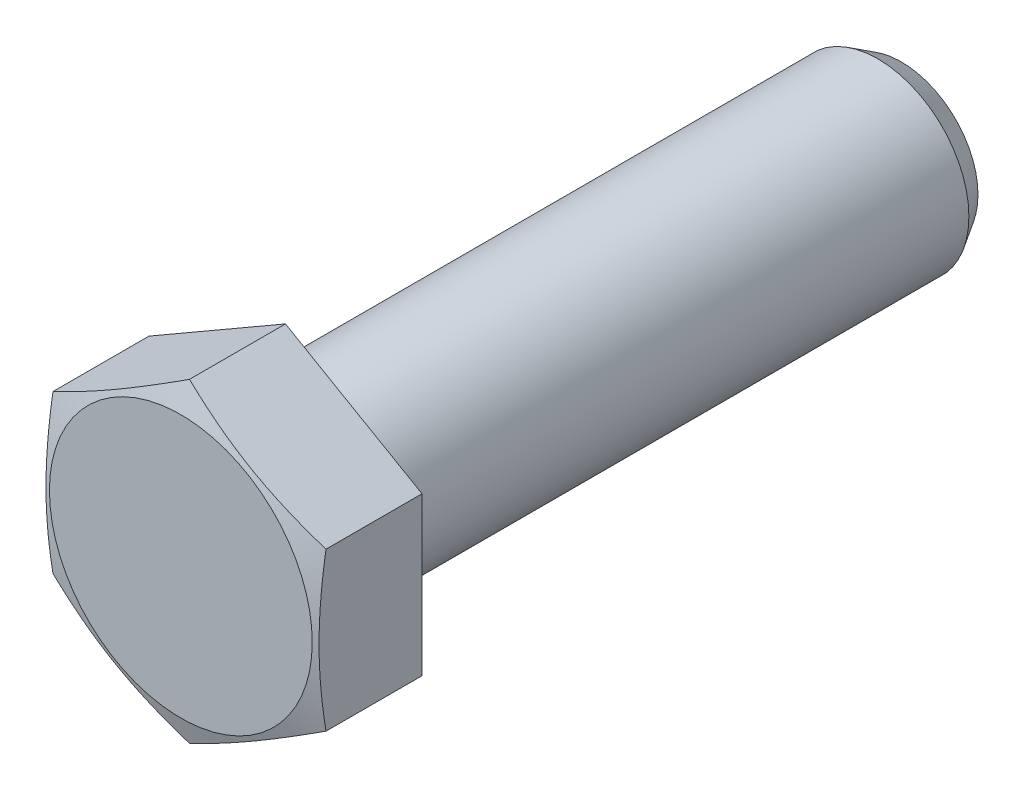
ISO-10303-21;
HEADER;
FILE_DESCRIPTION(('STEP AP214'),'2;1');
FILE_NAME('part.step','',(''),(''),'','','');
FILE_SCHEMA(('AUTOMOTIVE_DESIGN { 1 0 10303 214 1 1 1 1 }'));
ENDSEC;
DATA;
#1=APPLICATION_CONTEXT('core data for automotive mechanical design processes');
#2=APPLICATION_PROTOCOL_DEFINITION('international standard','automotive_design',2000,#1);
#3=PRODUCT_CONTEXT('',#1,'mechanical');
#4=PRODUCT('Part','Part','',(#3));
#5=PRODUCT_RELATED_PRODUCT_CATEGORY('part','',(#4));
#6=PRODUCT_DEFINITION_FORMATION('','',#4);
#7=PRODUCT_DEFINITION_CONTEXT('part definition',#1,'design');
#8=PRODUCT_DEFINITION('design','',#6,#7);
#9=PRODUCT_DEFINITION_SHAPE('','',#8);
#10=(LENGTH_UNIT() NAMED_UNIT(*) SI_UNIT(.MILLI.,.METRE.));
#11=(NAMED_UNIT(*) PLANE_ANGLE_UNIT() SI_UNIT($,.RADIAN.));
#12=(NAMED_UNIT(*) SI_UNIT($,.STERADIAN.) SOLID_ANGLE_UNIT());
#13=UNCERTAINTY_MEASURE_WITH_UNIT(LENGTH_MEASURE(1.E-05),#10,'distance_accuracy_value','');
#14=(GEOMETRIC_REPRESENTATION_CONTEXT(3) GLOBAL_UNCERTAINTY_ASSIGNED_CONTEXT((#13)) GLOBAL_UNIT_ASSIGNED_CONTEXT((#10,
#11,#12)) REPRESENTATION_CONTEXT('',''));
#15=CARTESIAN_POINT('',(0.,0.,0.));
#16=DIRECTION('',(0.,0.,1.));
#17=DIRECTION('',(1.,0.,0.));
#18=AXIS2_PLACEMENT_3D('',#15,#16,#17);
#19=CARTESIAN_POINT('',(0.,0.,0.6));
#20=DIRECTION('',(0.,0.,1.));
#21=DIRECTION('',(1.,0.,0.));
#22=AXIS2_PLACEMENT_3D('',#19,#20,#21);
#23=TOROIDAL_SURFACE('',#22,7.6,0.6);
#24=CARTESIAN_POINT('',(0.,0.,0.6));
#25=DIRECTION('',(0.,0.,1.));
#26=DIRECTION('',(1.,0.,0.));
#27=AXIS2_PLACEMENT_3D('',#24,#25,#26);
#28=CIRCLE('',#27,8.2);
#29=CARTESIAN_POINT('',(8.2,0.,0.600000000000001));
#30=VERTEX_POINT('',#29);
#31=EDGE_CURVE('E11',#30,#30,#28,.T.);
#32=ORIENTED_EDGE('',*,*,#31,.F.);
#33=EDGE_LOOP('',(#32));
#34=FACE_BOUND('',#33,.T.);
#35=CARTESIAN_POINT('',(0.,0.,0.));
#36=DIRECTION('',(0.,0.,1.));
#37=DIRECTION('',(1.,0.,0.));
#38=AXIS2_PLACEMENT_3D('',#35,#36,#37);
#39=CIRCLE('',#38,7.6);
#40=CARTESIAN_POINT('',(7.6,0.,0.));
#41=VERTEX_POINT('',#40);
#42=EDGE_CURVE('E39',#41,#41,#39,.T.);
#43=ORIENTED_EDGE('',*,*,#42,.T.);
#44=EDGE_LOOP('',(#43));
#45=FACE_BOUND('',#44,.T.);
#46=ADVANCED_FACE('F32',(#34,#45),#23,.T.);
#47=CARTESIAN_POINT('',(0.,7.6,0.));
#48=DIRECTION('',(0.,0.,-1.));
#49=DIRECTION('',(-1.,0.,0.));
#50=AXIS2_PLACEMENT_3D('',#47,#48,#49);
#51=PLANE('',#50);
#52=CARTESIAN_POINT('',(0.,0.,0.));
#53=DIRECTION('',(0.,0.,1.));
#54=DIRECTION('',(1.,0.,0.));
#55=AXIS2_PLACEMENT_3D('',#52,#53,#54);
#56=CIRCLE('',#55,6.6);
#57=CARTESIAN_POINT('',(6.6,0.,0.));
#58=VERTEX_POINT('',#57);
#59=EDGE_CURVE('E124',#58,#58,#56,.T.);
#60=ORIENTED_EDGE('',*,*,#59,.T.);
#61=EDGE_LOOP('',(#60));
#62=FACE_BOUND('',#61,.T.);
#63=ORIENTED_EDGE('',*,*,#42,.F.);
#64=EDGE_LOOP('',(#63));
#65=FACE_BOUND('',#64,.T.);
#66=ADVANCED_FACE('F130',(#62,#65),#51,.T.);
#67=CARTESIAN_POINT('',(0.,0.,-0.6));
#68=DIRECTION('',(0.,0.,1.));
#69=DIRECTION('',(1.,0.,0.));
#70=AXIS2_PLACEMENT_3D('',#67,#68,#69);
#71=TOROIDAL_SURFACE('',#70,6.6,0.6);
#72=CARTESIAN_POINT('',(0.,0.,-0.6));
#73=DIRECTION('',(0.,0.,1.));
#74=DIRECTION('',(1.,0.,0.));
#75=AXIS2_PLACEMENT_3D('',#72,#73,#74);
#76=CIRCLE('',#75,6.);
#77=CARTESIAN_POINT('',(6.,0.,-0.6));
#78=VERTEX_POINT('',#77);
#79=EDGE_CURVE('E121',#78,#78,#76,.T.);
#80=ORIENTED_EDGE('',*,*,#79,.T.);
#81=EDGE_LOOP('',(#80));
#82=FACE_BOUND('',#81,.T.);
#83=ORIENTED_EDGE('',*,*,#59,.F.);
#84=EDGE_LOOP('',(#83));
#85=FACE_BOUND('',#84,.T.);
#86=ADVANCED_FACE('F132',(#82,#85),#71,.F.);
#87=CARTESIAN_POINT('',(-9.,-5.19615,0.6));
#88=DIRECTION('',(0.,0.,-1.));
#89=DIRECTION('',(-1.,0.,0.));
#90=AXIS2_PLACEMENT_3D('',#87,#88,#89);
#91=PLANE('',#90);
#92=DIRECTION('',(0.,-1.,0.));
#93=VECTOR('',#92,1.);
#94=CARTESIAN_POINT('',(-9.,5.19615,0.6));
#95=LINE('',#94,#93);
#96=CARTESIAN_POINT('',(-9.,5.19615,0.6));
#97=VERTEX_POINT('',#96);
#98=CARTESIAN_POINT('',(-9.,-5.19615,0.6));
#99=VERTEX_POINT('',#98);
#100=EDGE_CURVE('E98',#97,#99,#95,.T.);
#101=ORIENTED_EDGE('',*,*,#100,.F.);
#102=DIRECTION('',(0.866025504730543,0.499999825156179,0.));
#103=VECTOR('',#102,1.);
#104=CARTESIAN_POINT('',(-9.,5.19615,0.6));
#105=LINE('',#104,#103);
#106=CARTESIAN_POINT('',(0.,10.3923,0.6));
#107=VERTEX_POINT('',#106);
#108=EDGE_CURVE('E103',#97,#107,#105,.T.);
#109=ORIENTED_EDGE('',*,*,#108,.T.);
#110=DIRECTION('',(0.866025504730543,-0.499999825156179,0.));
#111=VECTOR('',#110,1.);
#112=CARTESIAN_POINT('',(0.,10.3923,0.6));
#113=LINE('',#112,#111);
#114=CARTESIAN_POINT('',(9.,5.19615,0.6));
#115=VERTEX_POINT('',#114);
#116=EDGE_CURVE('E109',#107,#115,#113,.T.);
#117=ORIENTED_EDGE('',*,*,#116,.T.);
#118=DIRECTION('',(0.,-1.,0.));
#119=VECTOR('',#118,1.);
#120=CARTESIAN_POINT('',(9.,5.19615,0.6));
#121=LINE('',#120,#119);
#122=CARTESIAN_POINT('',(9.,-5.19615,0.6));
#123=VERTEX_POINT('',#122);
#124=EDGE_CURVE('E245',#115,#123,#121,.T.);
#125=ORIENTED_EDGE('',*,*,#124,.T.);
#126=DIRECTION('',(-0.866025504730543,-0.499999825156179,0.));
#127=VECTOR('',#126,1.);
#128=CARTESIAN_POINT('',(9.,-5.19615,0.6));
#129=LINE('',#128,#127);
#130=CARTESIAN_POINT('',(0.,-10.3923,0.6));
#131=VERTEX_POINT('',#130);
#132=EDGE_CURVE('E231',#123,#131,#129,.T.);
#133=ORIENTED_EDGE('',*,*,#132,.T.);
#134=DIRECTION('',(-0.866025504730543,0.499999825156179,0.));
#135=VECTOR('',#134,1.);
#136=CARTESIAN_POINT('',(0.,-10.3923,0.6));
#137=LINE('',#136,#135);
#138=EDGE_CURVE('E229',#131,#99,#137,.T.);
#139=ORIENTED_EDGE('',*,*,#138,.T.);
#140=EDGE_LOOP('',(#101,#109,#117,#125,#133,#139));
#141=FACE_BOUND('',#140,.T.);
#142=ORIENTED_EDGE('',*,*,#31,.T.);
#143=EDGE_LOOP('',(#142));
#144=FACE_BOUND('',#143,.T.);
#145=ADVANCED_FACE('F138',(#141,#144),#91,.T.);
#146=CARTESIAN_POINT('',(-9.,5.19615,0.6));
#147=DIRECTION('',(-1.,0.,0.));
#148=DIRECTION('',(0.,0.,1.));
#149=AXIS2_PLACEMENT_3D('',#146,#147,#148);
#150=PLANE('',#149);
#151=CARTESIAN_POINT('',(-9.,-13.7470885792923,4.93453459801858));
#152=CARTESIAN_POINT('',(-9.,-13.3392874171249,5.04718491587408));
#153=CARTESIAN_POINT('',(-9.,-12.9311091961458,5.15849505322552));
#154=CARTESIAN_POINT('',(-9.,-12.1138094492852,5.37769955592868));
#155=CARTESIAN_POINT('',(-9.,-11.7046878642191,5.48559370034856));
#156=CARTESIAN_POINT('',(-9.,-10.8847498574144,5.69737490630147));
#157=CARTESIAN_POINT('',(-9.,-10.4739318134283,5.80125570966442));
#158=CARTESIAN_POINT('',(-9.,-9.65101983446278,6.00383051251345));
#159=CARTESIAN_POINT('',(-9.,-9.23892591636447,6.10252458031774));
#160=CARTESIAN_POINT('',(-9.,-8.41811436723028,6.29233104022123));
#161=CARTESIAN_POINT('',(-9.,-8.0094143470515,6.38351921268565));
#162=CARTESIAN_POINT('',(-9.,-7.19032773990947,6.55804869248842));
#163=CARTESIAN_POINT('',(-9.,-6.77994114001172,6.64138993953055));
#164=CARTESIAN_POINT('',(-9.,-5.95738209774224,6.79830951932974));
#165=CARTESIAN_POINT('',(-9.,-5.54521006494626,6.8718899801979));
#166=CARTESIAN_POINT('',(-9.,-4.71888494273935,7.00707177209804));
#167=CARTESIAN_POINT('',(-9.,-4.30473186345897,7.0686731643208));
#168=CARTESIAN_POINT('',(-9.,-3.48183307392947,7.17648586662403));
#169=CARTESIAN_POINT('',(-9.,-3.07312089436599,7.22294955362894));
#170=CARTESIAN_POINT('',(-9.,-2.2541675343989,7.29970130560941));
#171=CARTESIAN_POINT('',(-9.,-1.84392640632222,7.32998991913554));
#172=CARTESIAN_POINT('',(-9.,-1.0227798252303,7.37263456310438));
#173=CARTESIAN_POINT('',(-9.,-0.611875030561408,7.38500302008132));
#174=CARTESIAN_POINT('',(-9.,0.210073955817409,7.39106039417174));
#175=CARTESIAN_POINT('',(-9.,0.621118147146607,7.38474936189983));
#176=CARTESIAN_POINT('',(-9.,1.44463812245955,7.35377442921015));
#177=CARTESIAN_POINT('',(-9.,1.85711025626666,7.32901539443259));
#178=CARTESIAN_POINT('',(-9.,2.68067263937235,7.26253252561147));
#179=CARTESIAN_POINT('',(-9.,3.09176284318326,7.22080813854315));
#180=CARTESIAN_POINT('',(-9.,3.91254232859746,7.12251563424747));
#181=CARTESIAN_POINT('',(-9.,4.32222985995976,7.0659331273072));
#182=CARTESIAN_POINT('',(-9.,5.13967057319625,6.94032062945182));
#183=CARTESIAN_POINT('',(-9.,5.54742374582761,6.87129057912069));
#184=CARTESIAN_POINT('',(-9.,6.34392226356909,6.72614777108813));
#185=CARTESIAN_POINT('',(-9.,6.73274502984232,6.65045563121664));
#186=CARTESIAN_POINT('',(-9.,7.50883064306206,6.49141952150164));
#187=CARTESIAN_POINT('',(-9.,7.89609341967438,6.40807521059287));
#188=CARTESIAN_POINT('',(-9.,8.66928474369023,6.2351536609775));
#189=CARTESIAN_POINT('',(-9.,9.05521306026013,6.14557539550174));
#190=CARTESIAN_POINT('',(-9.,9.82584964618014,5.96135982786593));
#191=CARTESIAN_POINT('',(-9.,10.2105579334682,5.86672260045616));
#192=CARTESIAN_POINT('',(-9.,10.9791002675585,5.67327627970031));
#193=CARTESIAN_POINT('',(-9.,11.3629338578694,5.57446537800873));
#194=CARTESIAN_POINT('',(-9.,12.1297113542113,5.37344471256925));
#195=CARTESIAN_POINT('',(-9.,12.5126552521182,5.27123491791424));
#196=CARTESIAN_POINT('',(-9.,13.6602702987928,4.96044653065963));
#197=CARTESIAN_POINT('',(-9.,14.4238088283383,4.74768748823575));
#198=CARTESIAN_POINT('',(-9.,15.9383314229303,4.31737090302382));
#199=CARTESIAN_POINT('',(-9.,16.689345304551,4.09991758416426));
#200=CARTESIAN_POINT('',(-9.,18.189792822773,3.65955502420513));
#201=CARTESIAN_POINT('',(-9.,18.9392264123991,3.43664562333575));
#202=CARTESIAN_POINT('',(-9.,20.4353823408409,2.98724599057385));
#203=CARTESIAN_POINT('',(-9.,21.1821071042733,2.76076381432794));
#204=CARTESIAN_POINT('',(-9.,22.3014752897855,2.41875920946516));
#205=CARTESIAN_POINT('',(-9.,22.674468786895,2.30438036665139));
#206=CARTESIAN_POINT('',(-9.,23.4202477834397,2.07494863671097));
#207=CARTESIAN_POINT('',(-9.,23.7930332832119,1.95989575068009));
#208=CARTESIAN_POINT('',(-9.,24.1657280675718,1.84454977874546));
#209=B_SPLINE_CURVE_WITH_KNOTS('',3,(#151,#152,#153,#154,#155,#156,#157,#158,#159,#160,#161,
#162,#163,#164,#165,#166,#167,#168,#169,#170,#171,#172,#173,#174,#175,#176,#177,#178,#179,#180,
#181,#182,#183,#184,#185,#186,#187,#188,#189,#190,#191,#192,#193,#194,#195,#196,#197,#198,#199,
#200,#201,#202,#203,#204,#205,#206,#207,#208),.UNSPECIFIED.,.F.,.F.,(4,2,2,2,2,2,2,2,2,2,2,2,2,
2,2,2,2,2,2,2,2,2,2,2,2,2,2,2,4),(0.,1.26923056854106,2.53854305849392,3.80976091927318,
5.08096203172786,6.33714874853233,7.59334511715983,8.84926714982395,10.1051827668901,
11.3389379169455,12.5726512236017,13.8055086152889,15.0383626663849,16.2776188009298,
17.5169153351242,18.7574165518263,19.9979236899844,21.1861971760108,22.3745236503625,
23.5630463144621,24.7515514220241,25.9405768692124,27.1296131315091,29.5074255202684,
31.8529867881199,34.1986168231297,36.5395543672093,37.7099640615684,38.8803718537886),.UNSPECIFIED.);
#210=CARTESIAN_POINT('',(-9.,5.19615,6.92894463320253));
#211=VERTEX_POINT('',#210);
#212=CARTESIAN_POINT('',(-9.,-5.19615,6.92894463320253));
#213=VERTEX_POINT('',#212);
#214=EDGE_CURVE('E87',#211,#213,#209,.F.);
#215=ORIENTED_EDGE('',*,*,#214,.F.);
#216=DIRECTION('',(0.,0.,1.));
#217=VECTOR('',#216,1.);
#218=CARTESIAN_POINT('',(-9.,5.19615,0.6));
#219=LINE('',#218,#217);
#220=EDGE_CURVE('E96',#97,#211,#219,.T.);
#221=ORIENTED_EDGE('',*,*,#220,.F.);
#222=ORIENTED_EDGE('',*,*,#100,.T.);
#223=DIRECTION('',(0.,0.,1.));
#224=VECTOR('',#223,1.);
#225=CARTESIAN_POINT('',(-9.,-5.19615,0.6));
#226=LINE('',#225,#224);
#227=EDGE_CURVE('E54',#99,#213,#226,.T.);
#228=ORIENTED_EDGE('',*,*,#227,.T.);
#229=EDGE_LOOP('',(#215,#221,#222,#228));
#230=FACE_BOUND('',#229,.T.);
#231=ADVANCED_FACE('F94',(#230),#150,.T.);
#232=CARTESIAN_POINT('',(0.,-10.3923,0.6));
#233=DIRECTION('',(0.499999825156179,0.866025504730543,0.));
#234=DIRECTION('',(0.866025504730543,-0.499999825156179,0.));
#235=AXIS2_PLACEMENT_3D('',#232,#233,#234);
#236=PLANE('',#235);
#237=DIRECTION('',(0.,0.,1.));
#238=VECTOR('',#237,1.);
#239=CARTESIAN_POINT('',(0.,-10.3923,0.6));
#240=LINE('',#239,#238);
#241=CARTESIAN_POINT('',(0.,-10.3923,6.92894583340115));
#242=VERTEX_POINT('',#241);
#243=EDGE_CURVE('E236',#131,#242,#240,.T.);
#244=ORIENTED_EDGE('',*,*,#243,.T.);
#245=CARTESIAN_POINT('',(1.9999999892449E-07,-10.39230011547,6.92894579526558));
#246=CARTESIAN_POINT('',(-0.373107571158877,-10.1768863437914,7.00011400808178));
#247=CARTESIAN_POINT('',(-0.747233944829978,-9.96088448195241,7.06480339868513));
#248=CARTESIAN_POINT('',(-1.49749109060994,-9.52772351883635,7.17855326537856));
#249=CARTESIAN_POINT('',(-1.87362298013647,-9.31056377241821,7.22760383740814));
#250=CARTESIAN_POINT('',(-2.62444400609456,-8.87707725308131,7.30699688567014));
#251=CARTESIAN_POINT('',(-2.99912148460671,-8.66075721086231,7.33748241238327));
#252=CARTESIAN_POINT('',(-3.74919949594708,-8.22769967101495,7.37836755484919));
#253=CARTESIAN_POINT('',(-4.1245997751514,-8.01096231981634,7.38877325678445));
#254=CARTESIAN_POINT('',(-4.87540032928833,-7.57748761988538,7.38877313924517));
#255=CARTESIAN_POINT('',(-5.25080060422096,-7.36075027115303,7.37836731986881));
#256=CARTESIAN_POINT('',(-6.00087860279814,-6.9276927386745,7.33748195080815));
#257=CARTESIAN_POINT('',(-6.37555607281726,-6.71137270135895,7.30699631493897));
#258=CARTESIAN_POINT('',(-7.12637707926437,-6.27788619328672,7.22760306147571));
#259=CARTESIAN_POINT('',(-7.50250895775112,-6.06072645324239,7.17855239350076));
#260=CARTESIAN_POINT('',(-8.25276607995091,-5.62756550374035,7.06480235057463));
#261=CARTESIAN_POINT('',(-8.62689244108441,-5.41156364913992,7.00011287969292));
#262=CARTESIAN_POINT('',(-9.0000002,-5.19614988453,6.92894459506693));
#263=B_SPLINE_CURVE_WITH_KNOTS('',3,(#245,#246,#247,#248,#249,#250,#251,#252,#253,#254,#255,
#256,#257,#258,#259,#260,#261,#262),.UNSPECIFIED.,.F.,.F.,(4,2,2,2,2,2,2,2,4),(0.,
1.31010734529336,2.62104274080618,3.9217446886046,5.22205233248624,6.52235997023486,
7.82306191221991,9.13399730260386,10.4441046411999),.UNSPECIFIED.);
#264=EDGE_CURVE('E99',#242,#213,#263,.T.);
#265=ORIENTED_EDGE('',*,*,#264,.T.);
#266=ORIENTED_EDGE('',*,*,#227,.F.);
#267=ORIENTED_EDGE('',*,*,#138,.F.);
#268=EDGE_LOOP('',(#244,#265,#266,#267));
#269=FACE_BOUND('',#268,.T.);
#270=ADVANCED_FACE('F159',(#269),#236,.F.);
#271=CARTESIAN_POINT('',(9.,-5.19615,0.6));
#272=DIRECTION('',(-0.499999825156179,0.866025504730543,0.));
#273=DIRECTION('',(0.866025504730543,0.499999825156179,0.));
#274=AXIS2_PLACEMENT_3D('',#271,#272,#273);
#275=PLANE('',#274);
#276=DIRECTION('',(0.,0.,1.));
#277=VECTOR('',#276,1.);
#278=CARTESIAN_POINT('',(9.,-5.19615,0.6));
#279=LINE('',#278,#277);
#280=CARTESIAN_POINT('',(9.,-5.19615,6.92894463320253));
#281=VERTEX_POINT('',#280);
#282=EDGE_CURVE('E239',#123,#281,#279,.T.);
#283=ORIENTED_EDGE('',*,*,#282,.T.);
#284=CARTESIAN_POINT('',(9.0000002,-5.19614988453,6.92894459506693));
#285=CARTESIAN_POINT('',(8.62689244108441,-5.41156364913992,7.00011287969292));
#286=CARTESIAN_POINT('',(8.25276607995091,-5.62756550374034,7.06480235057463));
#287=CARTESIAN_POINT('',(7.50250895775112,-6.06072645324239,7.17855239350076));
#288=CARTESIAN_POINT('',(7.12637707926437,-6.27788619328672,7.22760306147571));
#289=CARTESIAN_POINT('',(6.37555607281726,-6.71137270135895,7.30699631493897));
#290=CARTESIAN_POINT('',(6.00087860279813,-6.9276927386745,7.33748195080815));
#291=CARTESIAN_POINT('',(5.25080060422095,-7.36075027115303,7.37836731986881));
#292=CARTESIAN_POINT('',(4.87540032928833,-7.57748761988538,7.38877313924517));
#293=CARTESIAN_POINT('',(4.12459977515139,-8.01096231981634,7.38877325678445));
#294=CARTESIAN_POINT('',(3.74919949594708,-8.22769967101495,7.3783675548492));
#295=CARTESIAN_POINT('',(2.99912148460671,-8.66075721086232,7.33748241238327));
#296=CARTESIAN_POINT('',(2.62444400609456,-8.87707725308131,7.30699688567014));
#297=CARTESIAN_POINT('',(1.87362298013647,-9.31056377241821,7.22760383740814));
#298=CARTESIAN_POINT('',(1.49749109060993,-9.52772351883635,7.17855326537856));
#299=CARTESIAN_POINT('',(0.747233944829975,-9.96088448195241,7.06480339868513));
#300=CARTESIAN_POINT('',(0.373107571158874,-10.1768863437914,7.00011400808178));
#301=CARTESIAN_POINT('',(-2.00000003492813E-07,-10.39230011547,6.92894579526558));
#302=B_SPLINE_CURVE_WITH_KNOTS('',3,(#284,#285,#286,#287,#288,#289,#290,#291,#292,#293,#294,
#295,#296,#297,#298,#299,#300,#301),.UNSPECIFIED.,.F.,.F.,(4,2,2,2,2,2,2,2,4),(0.,
1.31010733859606,2.62104272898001,3.92174467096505,5.22205230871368,6.52235995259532,
7.82306190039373,9.13399729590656,10.4441046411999),.UNSPECIFIED.);
#303=EDGE_CURVE('E201',#281,#242,#302,.T.);
#304=ORIENTED_EDGE('',*,*,#303,.T.);
#305=ORIENTED_EDGE('',*,*,#243,.F.);
#306=ORIENTED_EDGE('',*,*,#132,.F.);
#307=EDGE_LOOP('',(#283,#304,#305,#306));
#308=FACE_BOUND('',#307,.T.);
#309=ADVANCED_FACE('F207',(#308),#275,.F.);
#310=CARTESIAN_POINT('',(9.,5.19615,0.6));
#311=DIRECTION('',(-1.,0.,0.));
#312=DIRECTION('',(0.,0.,1.));
#313=AXIS2_PLACEMENT_3D('',#310,#311,#312);
#314=PLANE('',#313);
#315=DIRECTION('',(0.,0.,1.));
#316=VECTOR('',#315,1.);
#317=CARTESIAN_POINT('',(9.,5.19615,0.6));
#318=LINE('',#317,#316);
#319=CARTESIAN_POINT('',(9.,5.19615,6.92894463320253));
#320=VERTEX_POINT('',#319);
#321=EDGE_CURVE('E107',#115,#320,#318,.T.);
#322=ORIENTED_EDGE('',*,*,#321,.T.);
#323=CARTESIAN_POINT('',(9.,-13.7470885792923,4.93453459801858));
#324=CARTESIAN_POINT('',(9.,-13.3392874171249,5.04718491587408));
#325=CARTESIAN_POINT('',(9.,-12.9311091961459,5.15849505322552));
#326=CARTESIAN_POINT('',(9.,-12.1138094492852,5.37769955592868));
#327=CARTESIAN_POINT('',(9.,-11.7046878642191,5.48559370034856));
#328=CARTESIAN_POINT('',(9.,-10.8847498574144,5.69737490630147));
#329=CARTESIAN_POINT('',(9.,-10.4739318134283,5.80125570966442));
#330=CARTESIAN_POINT('',(9.,-9.65101983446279,6.00383051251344));
#331=CARTESIAN_POINT('',(9.,-9.23892591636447,6.10252458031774));
#332=CARTESIAN_POINT('',(9.,-8.41811436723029,6.29233104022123));
#333=CARTESIAN_POINT('',(9.,-8.00941434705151,6.38351921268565));
#334=CARTESIAN_POINT('',(9.,-7.19032773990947,6.55804869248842));
#335=CARTESIAN_POINT('',(9.,-6.77994114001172,6.64138993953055));
#336=CARTESIAN_POINT('',(9.,-5.95738209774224,6.79830951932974));
#337=CARTESIAN_POINT('',(9.,-5.54521006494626,6.8718899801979));
#338=CARTESIAN_POINT('',(9.,-4.71888494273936,7.00707177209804));
#339=CARTESIAN_POINT('',(9.,-4.30473186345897,7.0686731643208));
#340=CARTESIAN_POINT('',(9.,-3.48183307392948,7.17648586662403));
#341=CARTESIAN_POINT('',(9.,-3.073120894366,7.22294955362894));
#342=CARTESIAN_POINT('',(9.,-2.25416753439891,7.29970130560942));
#343=CARTESIAN_POINT('',(9.,-1.84392640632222,7.32998991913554));
#344=CARTESIAN_POINT('',(9.,-1.0227798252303,7.37263456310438));
#345=CARTESIAN_POINT('',(9.,-0.611875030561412,7.38500302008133));
#346=CARTESIAN_POINT('',(9.,0.210073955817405,7.39106039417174));
#347=CARTESIAN_POINT('',(9.,0.621118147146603,7.38474936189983));
#348=CARTESIAN_POINT('',(9.,1.44463812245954,7.35377442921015));
#349=CARTESIAN_POINT('',(9.,1.85711025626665,7.32901539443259));
#350=CARTESIAN_POINT('',(9.,2.68067263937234,7.26253252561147));
#351=CARTESIAN_POINT('',(9.,3.09176284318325,7.22080813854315));
#352=CARTESIAN_POINT('',(9.,3.91254232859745,7.12251563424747));
#353=CARTESIAN_POINT('',(9.,4.32222985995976,7.06593312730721));
#354=CARTESIAN_POINT('',(9.,5.13967057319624,6.94032062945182));
#355=CARTESIAN_POINT('',(9.,5.5474237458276,6.87129057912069));
#356=CARTESIAN_POINT('',(9.,6.34392226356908,6.72614777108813));
#357=CARTESIAN_POINT('',(9.,6.73274502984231,6.65045563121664));
#358=CARTESIAN_POINT('',(9.,7.50883064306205,6.49141952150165));
#359=CARTESIAN_POINT('',(9.,7.89609341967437,6.40807521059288));
#360=CARTESIAN_POINT('',(9.,8.66928474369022,6.2351536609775));
#361=CARTESIAN_POINT('',(9.,9.05521306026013,6.14557539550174));
#362=CARTESIAN_POINT('',(9.,9.82584964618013,5.96135982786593));
#363=CARTESIAN_POINT('',(9.,10.2105579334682,5.86672260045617));
#364=CARTESIAN_POINT('',(9.,10.9791002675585,5.67327627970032));
#365=CARTESIAN_POINT('',(9.,11.3629338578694,5.57446537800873));
#366=CARTESIAN_POINT('',(9.,12.1297113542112,5.37344471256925));
#367=CARTESIAN_POINT('',(9.,12.5126552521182,5.27123491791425));
#368=CARTESIAN_POINT('',(9.,13.6602702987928,4.96044653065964));
#369=CARTESIAN_POINT('',(9.,14.4238088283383,4.74768748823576));
#370=CARTESIAN_POINT('',(9.,15.9383314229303,4.31737090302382));
#371=CARTESIAN_POINT('',(9.,16.689345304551,4.09991758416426));
#372=CARTESIAN_POINT('',(9.,18.189792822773,3.65955502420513));
#373=CARTESIAN_POINT('',(9.,18.9392264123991,3.43664562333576));
#374=CARTESIAN_POINT('',(9.,20.4353823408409,2.98724599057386));
#375=CARTESIAN_POINT('',(9.,21.1821071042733,2.76076381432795));
#376=CARTESIAN_POINT('',(9.,22.3014752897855,2.41875920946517));
#377=CARTESIAN_POINT('',(9.,22.674468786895,2.30438036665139));
#378=CARTESIAN_POINT('',(9.,23.4202477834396,2.07494863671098));
#379=CARTESIAN_POINT('',(9.,23.7930332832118,1.95989575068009));
#380=CARTESIAN_POINT('',(9.,24.1657280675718,1.84454977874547));
#381=B_SPLINE_CURVE_WITH_KNOTS('',3,(#323,#324,#325,#326,#327,#328,#329,#330,#331,#332,#333,
#334,#335,#336,#337,#338,#339,#340,#341,#342,#343,#344,#345,#346,#347,#348,#349,#350,#351,#352,
#353,#354,#355,#356,#357,#358,#359,#360,#361,#362,#363,#364,#365,#366,#367,#368,#369,#370,#371,
#372,#373,#374,#375,#376,#377,#378,#379,#380),.UNSPECIFIED.,.F.,.F.,(4,2,2,2,2,2,2,2,2,2,2,2,2,
2,2,2,2,2,2,2,2,2,2,2,2,2,2,2,4),(0.,1.26923056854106,2.53854305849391,3.80976091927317,
5.08096203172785,6.33714874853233,7.59334511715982,8.84926714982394,10.1051827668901,
11.3389379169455,12.5726512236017,13.8055086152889,15.0383626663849,16.2776188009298,
17.5169153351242,18.7574165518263,19.9979236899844,21.1861971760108,22.3745236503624,
23.5630463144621,24.751551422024,25.9405768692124,27.1296131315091,29.5074255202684,
31.8529867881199,34.1986168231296,36.5395543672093,37.7099640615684,38.8803718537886),.UNSPECIFIED.);
#382=EDGE_CURVE('E195',#320,#281,#381,.F.);
#383=ORIENTED_EDGE('',*,*,#382,.T.);
#384=ORIENTED_EDGE('',*,*,#282,.F.);
#385=ORIENTED_EDGE('',*,*,#124,.F.);
#386=EDGE_LOOP('',(#322,#383,#384,#385));
#387=FACE_BOUND('',#386,.T.);
#388=ADVANCED_FACE('F210',(#387),#314,.F.);
#389=CARTESIAN_POINT('',(0.,10.3923,0.6));
#390=DIRECTION('',(-0.499999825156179,-0.866025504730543,0.));
#391=DIRECTION('',(-0.866025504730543,0.499999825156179,0.));
#392=AXIS2_PLACEMENT_3D('',#389,#390,#391);
#393=PLANE('',#392);
#394=DIRECTION('',(0.,0.,1.));
#395=VECTOR('',#394,1.);
#396=CARTESIAN_POINT('',(0.,10.3923,0.6));
#397=LINE('',#396,#395);
#398=CARTESIAN_POINT('',(0.,10.3923,6.92894583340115));
#399=VERTEX_POINT('',#398);
#400=EDGE_CURVE('E105',#107,#399,#397,.T.);
#401=ORIENTED_EDGE('',*,*,#400,.T.);
#402=CARTESIAN_POINT('',(-1.99999998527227E-07,10.39230011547,6.92894579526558));
#403=CARTESIAN_POINT('',(0.373107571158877,10.1768863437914,7.00011400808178));
#404=CARTESIAN_POINT('',(0.747233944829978,9.96088448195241,7.06480339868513));
#405=CARTESIAN_POINT('',(1.49749109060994,9.52772351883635,7.17855326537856));
#406=CARTESIAN_POINT('',(1.87362298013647,9.31056377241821,7.22760383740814));
#407=CARTESIAN_POINT('',(2.62444400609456,8.87707725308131,7.30699688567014));
#408=CARTESIAN_POINT('',(2.99912148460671,8.66075721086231,7.33748241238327));
#409=CARTESIAN_POINT('',(3.74919949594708,8.22769967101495,7.37836755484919));
#410=CARTESIAN_POINT('',(4.1245997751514,8.01096231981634,7.38877325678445));
#411=CARTESIAN_POINT('',(4.87540032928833,7.57748761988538,7.38877313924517));
#412=CARTESIAN_POINT('',(5.25080060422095,7.36075027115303,7.37836731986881));
#413=CARTESIAN_POINT('',(6.00087860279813,6.9276927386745,7.33748195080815));
#414=CARTESIAN_POINT('',(6.37555607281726,6.71137270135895,7.30699631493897));
#415=CARTESIAN_POINT('',(7.12637707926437,6.27788619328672,7.22760306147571));
#416=CARTESIAN_POINT('',(7.50250895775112,6.06072645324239,7.17855239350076));
#417=CARTESIAN_POINT('',(8.25276607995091,5.62756550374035,7.06480235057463));
#418=CARTESIAN_POINT('',(8.62689244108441,5.41156364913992,7.00011287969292));
#419=CARTESIAN_POINT('',(9.0000002,5.19614988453,6.92894459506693));
#420=B_SPLINE_CURVE_WITH_KNOTS('',3,(#402,#403,#404,#405,#406,#407,#408,#409,#410,#411,#412,
#413,#414,#415,#416,#417,#418,#419),.UNSPECIFIED.,.F.,.F.,(4,2,2,2,2,2,2,2,4),(0.,
1.31010734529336,2.62104274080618,3.9217446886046,5.22205233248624,6.52235997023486,
7.82306191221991,9.13399730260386,10.4441046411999),.UNSPECIFIED.);
#421=EDGE_CURVE('E46',#399,#320,#420,.T.);
#422=ORIENTED_EDGE('',*,*,#421,.T.);
#423=ORIENTED_EDGE('',*,*,#321,.F.);
#424=ORIENTED_EDGE('',*,*,#116,.F.);
#425=EDGE_LOOP('',(#401,#422,#423,#424));
#426=FACE_BOUND('',#425,.T.);
#427=ADVANCED_FACE('F214',(#426),#393,.F.);
#428=CARTESIAN_POINT('',(-9.,5.19615,0.6));
#429=DIRECTION('',(0.499999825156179,-0.866025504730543,0.));
#430=DIRECTION('',(-0.866025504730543,-0.499999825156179,0.));
#431=AXIS2_PLACEMENT_3D('',#428,#429,#430);
#432=PLANE('',#431);
#433=ORIENTED_EDGE('',*,*,#220,.T.);
#434=CARTESIAN_POINT('',(-9.0000002,5.19614988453,6.92894459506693));
#435=CARTESIAN_POINT('',(-8.62689244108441,5.41156364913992,7.00011287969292));
#436=CARTESIAN_POINT('',(-8.25276607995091,5.62756550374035,7.06480235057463));
#437=CARTESIAN_POINT('',(-7.50250895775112,6.06072645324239,7.17855239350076));
#438=CARTESIAN_POINT('',(-7.12637707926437,6.27788619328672,7.22760306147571));
#439=CARTESIAN_POINT('',(-6.37555607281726,6.71137270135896,7.30699631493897));
#440=CARTESIAN_POINT('',(-6.00087860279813,6.9276927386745,7.33748195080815));
#441=CARTESIAN_POINT('',(-5.25080060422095,7.36075027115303,7.37836731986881));
#442=CARTESIAN_POINT('',(-4.87540032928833,7.57748761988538,7.38877313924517));
#443=CARTESIAN_POINT('',(-4.12459977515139,8.01096231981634,7.38877325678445));
#444=CARTESIAN_POINT('',(-3.74919949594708,8.22769967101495,7.37836755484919));
#445=CARTESIAN_POINT('',(-2.99912148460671,8.66075721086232,7.33748241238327));
#446=CARTESIAN_POINT('',(-2.62444400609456,8.87707725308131,7.30699688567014));
#447=CARTESIAN_POINT('',(-1.87362298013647,9.31056377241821,7.22760383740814));
#448=CARTESIAN_POINT('',(-1.49749109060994,9.52772351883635,7.17855326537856));
#449=CARTESIAN_POINT('',(-0.747233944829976,9.96088448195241,7.06480339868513));
#450=CARTESIAN_POINT('',(-0.373107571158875,10.1768863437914,7.00011400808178));
#451=CARTESIAN_POINT('',(2.00000002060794E-07,10.39230011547,6.92894579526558));
#452=B_SPLINE_CURVE_WITH_KNOTS('',3,(#434,#435,#436,#437,#438,#439,#440,#441,#442,#443,#444,
#445,#446,#447,#448,#449,#450,#451),.UNSPECIFIED.,.F.,.F.,(4,2,2,2,2,2,2,2,4),(0.,
1.31010733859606,2.62104272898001,3.92174467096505,5.22205230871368,6.52235995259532,
7.82306190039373,9.13399729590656,10.4441046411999),.UNSPECIFIED.);
#453=EDGE_CURVE('E83',#211,#399,#452,.T.);
#454=ORIENTED_EDGE('',*,*,#453,.T.);
#455=ORIENTED_EDGE('',*,*,#400,.F.);
#456=ORIENTED_EDGE('',*,*,#108,.F.);
#457=EDGE_LOOP('',(#433,#454,#455,#456));
#458=FACE_BOUND('',#457,.T.);
#459=ADVANCED_FACE('F101',(#458),#432,.F.);
#460=CARTESIAN_POINT('',(0.,0.,6.86030181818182));
#461=DIRECTION('',(0.,0.,-1.));
#462=DIRECTION('',(-1.,0.,0.));
#463=AXIS2_PLACEMENT_3D('',#460,#461,#462);
#464=CONICAL_SURFACE('',#463,10.600146,1.25181086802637);
#465=ORIENTED_EDGE('',*,*,#214,.T.);
#466=ORIENTED_EDGE('',*,*,#264,.F.);
#467=ORIENTED_EDGE('',*,*,#303,.F.);
#468=ORIENTED_EDGE('',*,*,#382,.F.);
#469=ORIENTED_EDGE('',*,*,#421,.F.);
#470=ORIENTED_EDGE('',*,*,#453,.F.);
#471=EDGE_LOOP('',(#465,#466,#467,#468,#469,#470));
#472=FACE_BOUND('',#471,.T.);
#473=CARTESIAN_POINT('',(0.,0.,7.5));
#474=DIRECTION('',(0.,0.,-1.));
#475=DIRECTION('',(-1.,0.,0.));
#476=AXIS2_PLACEMENT_3D('',#473,#474,#475);
#477=CIRCLE('',#476,8.66321518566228);
#478=CARTESIAN_POINT('',(-8.66321518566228,0.,7.5));
#479=VERTEX_POINT('',#478);
#480=EDGE_CURVE('E91',#479,#479,#477,.F.);
#481=ORIENTED_EDGE('',*,*,#480,.F.);
#482=EDGE_LOOP('',(#481));
#483=FACE_BOUND('',#482,.T.);
#484=ADVANCED_FACE('F85',(#472,#483),#464,.T.);
#485=CARTESIAN_POINT('',(-9.,-5.19615,7.5));
#486=DIRECTION('',(0.,0.,-1.));
#487=DIRECTION('',(-1.,0.,0.));
#488=AXIS2_PLACEMENT_3D('',#485,#486,#487);
#489=PLANE('',#488);
#490=ORIENTED_EDGE('',*,*,#480,.T.);
#491=EDGE_LOOP('',(#490));
#492=FACE_BOUND('',#491,.T.);
#493=ADVANCED_FACE('F154',(#492),#489,.F.);
#494=CARTESIAN_POINT('',(0.,5.0528125,-40.));
#495=DIRECTION('',(0.,0.,-1.));
#496=DIRECTION('',(-1.,0.,0.));
#497=AXIS2_PLACEMENT_3D('',#494,#495,#496);
#498=PLANE('',#497);
#499=CARTESIAN_POINT('',(0.,0.,-40.));
#500=DIRECTION('',(0.,0.,1.));
#501=DIRECTION('',(1.,0.,0.));
#502=AXIS2_PLACEMENT_3D('',#499,#500,#501);
#503=CIRCLE('',#502,5.0528125);
#504=CARTESIAN_POINT('',(5.0528125,0.,-40.));
#505=VERTEX_POINT('',#504);
#506=EDGE_CURVE('E115',#505,#505,#503,.T.);
#507=ORIENTED_EDGE('',*,*,#506,.F.);
#508=EDGE_LOOP('',(#507));
#509=FACE_BOUND('',#508,.T.);
#510=ADVANCED_FACE('F150',(#509),#498,.T.);
#511=CARTESIAN_POINT('',(0.,0.,-38.4528125));
#512=DIRECTION('',(0.,0.,1.));
#513=DIRECTION('',(1.,0.,0.));
#514=AXIS2_PLACEMENT_3D('',#511,#512,#513);
#515=CONICAL_SURFACE('',#514,6.,0.549341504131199);
#516=ORIENTED_EDGE('',*,*,#506,.T.);
#517=EDGE_LOOP('',(#516));
#518=FACE_BOUND('',#517,.T.);
#519=CARTESIAN_POINT('',(0.,0.,-38.4528125));
#520=DIRECTION('',(0.,0.,1.));
#521=DIRECTION('',(1.,0.,0.));
#522=AXIS2_PLACEMENT_3D('',#519,#520,#521);
#523=CIRCLE('',#522,6.);
#524=CARTESIAN_POINT('',(6.,0.,-38.4528125));
#525=VERTEX_POINT('',#524);
#526=EDGE_CURVE('E118',#525,#525,#523,.T.);
#527=ORIENTED_EDGE('',*,*,#526,.F.);
#528=EDGE_LOOP('',(#527));
#529=FACE_BOUND('',#528,.T.);
#530=ADVANCED_FACE('F146',(#518,#529),#515,.T.);
#531=CARTESIAN_POINT('',(0.,0.,0.6));
#532=DIRECTION('',(0.,0.,1.));
#533=DIRECTION('',(1.,0.,0.));
#534=AXIS2_PLACEMENT_3D('',#531,#532,#533);
#535=CYLINDRICAL_SURFACE('',#534,6.);
#536=ORIENTED_EDGE('',*,*,#526,.T.);
#537=EDGE_LOOP('',(#536));
#538=FACE_BOUND('',#537,.T.);
#539=ORIENTED_EDGE('',*,*,#79,.F.);
#540=EDGE_LOOP('',(#539));
#541=FACE_BOUND('',#540,.T.);
#542=ADVANCED_FACE('F143',(#538,#541),#535,.T.);
#543=CLOSED_SHELL('',(#46,#66,#86,#145,#231,#270,#309,#388,#427,#459,#484,#493,#510,#530,#542));
#544=MANIFOLD_SOLID_BREP('B2',#543);
#545=ADVANCED_BREP_SHAPE_REPRESENTATION('',(#18,#544),#14);
#546=SHAPE_DEFINITION_REPRESENTATION(#9,#545);
ENDSEC;
END-ISO-10303-21;
